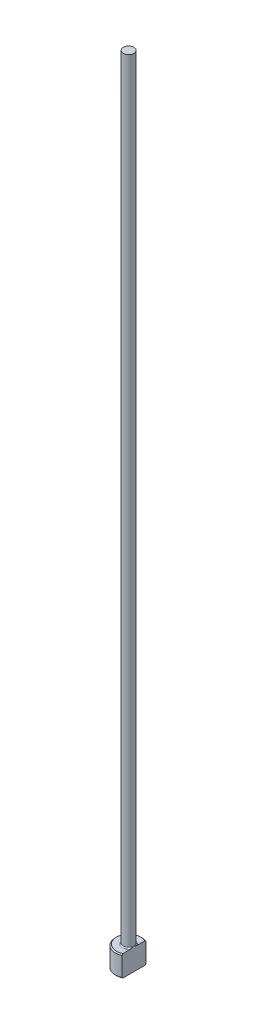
ISO-10303-21;
HEADER;
FILE_DESCRIPTION(('STEP AP214'),'2;1');
FILE_NAME('part.step','',(''),(''),'','','');
FILE_SCHEMA(('AUTOMOTIVE_DESIGN { 1 0 10303 214 1 1 1 1 }'));
ENDSEC;
DATA;
#1=APPLICATION_CONTEXT('core data for automotive mechanical design processes');
#2=APPLICATION_PROTOCOL_DEFINITION('international standard','automotive_design',2000,#1);
#3=PRODUCT_CONTEXT('',#1,'mechanical');
#4=PRODUCT('Part','Part','',(#3));
#5=PRODUCT_RELATED_PRODUCT_CATEGORY('part','',(#4));
#6=PRODUCT_DEFINITION_FORMATION('','',#4);
#7=PRODUCT_DEFINITION_CONTEXT('part definition',#1,'design');
#8=PRODUCT_DEFINITION('design','',#6,#7);
#9=PRODUCT_DEFINITION_SHAPE('','',#8);
#10=(LENGTH_UNIT() NAMED_UNIT(*) SI_UNIT(.MILLI.,.METRE.));
#11=(NAMED_UNIT(*) PLANE_ANGLE_UNIT() SI_UNIT($,.RADIAN.));
#12=(NAMED_UNIT(*) SI_UNIT($,.STERADIAN.) SOLID_ANGLE_UNIT());
#13=UNCERTAINTY_MEASURE_WITH_UNIT(LENGTH_MEASURE(1.E-05),#10,'distance_accuracy_value','');
#14=(GEOMETRIC_REPRESENTATION_CONTEXT(3) GLOBAL_UNCERTAINTY_ASSIGNED_CONTEXT((#13)) GLOBAL_UNIT_ASSIGNED_CONTEXT((#10,
#11,#12)) REPRESENTATION_CONTEXT('',''));
#15=CARTESIAN_POINT('',(0.,0.,0.));
#16=DIRECTION('',(0.,0.,1.));
#17=DIRECTION('',(1.,0.,0.));
#18=AXIS2_PLACEMENT_3D('',#15,#16,#17);
#19=CARTESIAN_POINT('',(0.,0.,0.));
#20=DIRECTION('',(0.,-1.,0.));
#21=DIRECTION('',(0.,0.,-1.));
#22=AXIS2_PLACEMENT_3D('',#19,#20,#21);
#23=PLANE('',#22);
#24=CARTESIAN_POINT('',(0.,0.,0.));
#25=DIRECTION('',(0.,-1.,0.));
#26=DIRECTION('',(0.,0.,-1.));
#27=AXIS2_PLACEMENT_3D('',#24,#25,#26);
#28=CIRCLE('',#27,2.29999999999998);
#29=CARTESIAN_POINT('',(0.999999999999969,0.,2.07123151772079));
#30=VERTEX_POINT('',#29);
#31=CARTESIAN_POINT('',(0.999999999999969,0.,-2.07123151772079));
#32=VERTEX_POINT('',#31);
#33=EDGE_CURVE('E98',#30,#32,#28,.T.);
#34=ORIENTED_EDGE('',*,*,#33,.T.);
#35=DIRECTION('',(0.,0.,1.));
#36=VECTOR('',#35,1.);
#37=CARTESIAN_POINT('',(0.999999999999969,0.,2.2912878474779));
#38=LINE('',#37,#36);
#39=EDGE_CURVE('E83',#32,#30,#38,.T.);
#40=ORIENTED_EDGE('',*,*,#39,.T.);
#41=EDGE_LOOP('',(#34,#40));
#42=FACE_BOUND('',#41,.T.);
#43=ADVANCED_FACE('F32',(#42),#23,.T.);
#44=CARTESIAN_POINT('',(0.,259.958771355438,0.));
#45=DIRECTION('',(0.,1.,0.));
#46=DIRECTION('',(0.,0.,1.));
#47=AXIS2_PLACEMENT_3D('',#44,#45,#46);
#48=CYLINDRICAL_SURFACE('',#47,2.49999999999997);
#49=CARTESIAN_POINT('',(0.,3.80000000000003,0.));
#50=DIRECTION('',(0.,1.,0.));
#51=DIRECTION('',(0.,0.,1.));
#52=AXIS2_PLACEMENT_3D('',#49,#50,#51);
#53=CIRCLE('',#52,2.49999999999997);
#54=CARTESIAN_POINT('',(0.999999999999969,3.80000000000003,2.2912878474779));
#55=VERTEX_POINT('',#54);
#56=CARTESIAN_POINT('',(0.999999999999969,3.80000000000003,-2.2912878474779));
#57=VERTEX_POINT('',#56);
#58=EDGE_CURVE('E104',#55,#57,#53,.F.);
#59=ORIENTED_EDGE('',*,*,#58,.T.);
#60=DIRECTION('',(0.,-1.,0.));
#61=VECTOR('',#60,1.);
#62=CARTESIAN_POINT('',(0.999999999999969,150.,-2.2912878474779));
#63=LINE('',#62,#61);
#64=CARTESIAN_POINT('',(0.999999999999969,0.199999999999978,-2.2912878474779));
#65=VERTEX_POINT('',#64);
#66=EDGE_CURVE('E183',#57,#65,#63,.T.);
#67=ORIENTED_EDGE('',*,*,#66,.T.);
#68=CARTESIAN_POINT('',(0.,0.199999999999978,0.));
#69=DIRECTION('',(0.,-1.,0.));
#70=DIRECTION('',(0.,0.,-1.));
#71=AXIS2_PLACEMENT_3D('',#68,#69,#70);
#72=CIRCLE('',#71,2.49999999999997);
#73=CARTESIAN_POINT('',(0.999999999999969,0.199999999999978,2.2912878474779));
#74=VERTEX_POINT('',#73);
#75=EDGE_CURVE('E100',#65,#74,#72,.F.);
#76=ORIENTED_EDGE('',*,*,#75,.T.);
#77=DIRECTION('',(0.,-1.,0.));
#78=VECTOR('',#77,1.);
#79=CARTESIAN_POINT('',(0.999999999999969,150.,2.2912878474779));
#80=LINE('',#79,#78);
#81=EDGE_CURVE('E93',#55,#74,#80,.T.);
#82=ORIENTED_EDGE('',*,*,#81,.F.);
#83=EDGE_LOOP('',(#59,#67,#76,#82));
#84=FACE_BOUND('',#83,.T.);
#85=ADVANCED_FACE('F158',(#84),#48,.T.);
#86=CARTESIAN_POINT('',(-2.49999999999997,4.,0.));
#87=DIRECTION('',(0.,1.,0.));
#88=DIRECTION('',(0.,0.,1.));
#89=AXIS2_PLACEMENT_3D('',#86,#87,#88);
#90=PLANE('',#89);
#91=CARTESIAN_POINT('',(0.,4.,0.));
#92=DIRECTION('',(0.,1.,0.));
#93=DIRECTION('',(0.,0.,1.));
#94=AXIS2_PLACEMENT_3D('',#91,#92,#93);
#95=CIRCLE('',#94,2.29999999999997);
#96=CARTESIAN_POINT('',(0.999999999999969,4.,-2.07123151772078));
#97=VERTEX_POINT('',#96);
#98=CARTESIAN_POINT('',(0.999999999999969,4.,2.07123151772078));
#99=VERTEX_POINT('',#98);
#100=EDGE_CURVE('E178',#97,#99,#95,.T.);
#101=ORIENTED_EDGE('',*,*,#100,.T.);
#102=DIRECTION('',(0.,0.,-1.));
#103=VECTOR('',#102,1.);
#104=CARTESIAN_POINT('',(0.999999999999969,4.,0.));
#105=LINE('',#104,#103);
#106=CARTESIAN_POINT('',(0.999999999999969,3.99999999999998,0.663324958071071));
#107=VERTEX_POINT('',#106);
#108=EDGE_CURVE('E57',#99,#107,#105,.T.);
#109=ORIENTED_EDGE('',*,*,#108,.T.);
#110=CARTESIAN_POINT('',(0.,4.,0.));
#111=DIRECTION('',(0.,1.,0.));
#112=DIRECTION('',(0.,0.,1.));
#113=AXIS2_PLACEMENT_3D('',#110,#111,#112);
#114=CIRCLE('',#113,1.19999999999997);
#115=CARTESIAN_POINT('',(0.999999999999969,3.99999999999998,-0.663324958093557));
#116=VERTEX_POINT('',#115);
#117=EDGE_CURVE('E107',#107,#116,#114,.F.);
#118=ORIENTED_EDGE('',*,*,#117,.T.);
#119=EDGE_CURVE('E136',#116,#97,#105,.T.);
#120=ORIENTED_EDGE('',*,*,#119,.T.);
#121=EDGE_LOOP('',(#101,#109,#118,#120));
#122=FACE_BOUND('',#121,.T.);
#123=ADVANCED_FACE('F147',(#122),#90,.T.);
#124=CARTESIAN_POINT('',(0.,4.,0.));
#125=DIRECTION('',(0.,-1.,0.));
#126=DIRECTION('',(0.,0.,-1.));
#127=AXIS2_PLACEMENT_3D('',#124,#125,#126);
#128=CONICAL_SURFACE('',#127,2.29999999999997,0.785398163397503);
#129=ORIENTED_EDGE('',*,*,#58,.F.);
#130=CARTESIAN_POINT('',(0.999999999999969,1.15817039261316,5.043650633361));
#131=CARTESIAN_POINT('',(0.999999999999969,1.28171614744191,4.91769392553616));
#132=CARTESIAN_POINT('',(0.999999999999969,1.40517853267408,4.79165523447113));
#133=CARTESIAN_POINT('',(0.999999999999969,1.65205736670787,4.5391725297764));
#134=CARTESIAN_POINT('',(0.999999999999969,1.77547348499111,4.4127281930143));
#135=CARTESIAN_POINT('',(0.999999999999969,2.02507999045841,4.1564175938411));
#136=CARTESIAN_POINT('',(0.999999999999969,2.15126317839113,4.02654431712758));
#137=CARTESIAN_POINT('',(0.999999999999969,2.40304621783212,3.76660249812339));
#138=CARTESIAN_POINT('',(0.999999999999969,2.52864665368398,3.63653452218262));
#139=CARTESIAN_POINT('',(0.999999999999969,2.76776970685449,3.38787610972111));
#140=CARTESIAN_POINT('',(0.999999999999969,2.88133977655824,3.26933134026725));
#141=CARTESIAN_POINT('',(0.999999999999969,3.10787167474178,3.03166264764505));
#142=CARTESIAN_POINT('',(0.999999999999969,3.22083350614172,2.91253872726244));
#143=CARTESIAN_POINT('',(0.999999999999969,3.44656995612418,2.67277252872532));
#144=CARTESIAN_POINT('',(0.999999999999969,3.5593394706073,2.55212543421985));
#145=CARTESIAN_POINT('',(0.999999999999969,3.78351625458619,2.30972256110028));
#146=CARTESIAN_POINT('',(0.999999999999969,3.89492439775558,2.18796759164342));
#147=CARTESIAN_POINT('',(0.999999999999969,4.1131873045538,1.9454858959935));
#148=CARTESIAN_POINT('',(0.999999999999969,4.2200877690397,1.82480064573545));
#149=CARTESIAN_POINT('',(0.999999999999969,4.37813361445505,1.64149718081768));
#150=CARTESIAN_POINT('',(0.999999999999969,4.43049954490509,1.57993333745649));
#151=CARTESIAN_POINT('',(0.999999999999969,4.53410631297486,1.45586813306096));
#152=CARTESIAN_POINT('',(0.999999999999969,4.58534721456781,1.39336682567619));
#153=CARTESIAN_POINT('',(0.999999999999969,4.68568582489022,1.26783988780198));
#154=CARTESIAN_POINT('',(0.999999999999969,4.73480144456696,1.20482863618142));
#155=CARTESIAN_POINT('',(0.999999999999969,4.83086890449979,1.07709082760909));
#156=CARTESIAN_POINT('',(0.999999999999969,4.87781921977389,1.01236311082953));
#157=CARTESIAN_POINT('',(0.999999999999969,4.96818560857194,0.880911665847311));
#158=CARTESIAN_POINT('',(0.999999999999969,5.01161706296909,0.814198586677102));
#159=CARTESIAN_POINT('',(0.999999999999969,5.09325231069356,0.677671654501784));
#160=CARTESIAN_POINT('',(0.999999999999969,5.1314648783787,0.60786327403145));
#161=CARTESIAN_POINT('',(0.999999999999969,5.1726089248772,0.520757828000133));
#162=CARTESIAN_POINT('',(0.999999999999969,5.17963219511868,0.505387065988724));
#163=CARTESIAN_POINT('',(0.999999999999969,5.19324475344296,0.474448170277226));
#164=CARTESIAN_POINT('',(0.999999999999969,5.19983388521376,0.458879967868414));
#165=CARTESIAN_POINT('',(0.999999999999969,5.21887613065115,0.411884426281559));
#166=CARTESIAN_POINT('',(0.999999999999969,5.23060772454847,0.380158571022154));
#167=CARTESIAN_POINT('',(0.999999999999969,5.25156131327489,0.316410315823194));
#168=CARTESIAN_POINT('',(0.999999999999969,5.26081845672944,0.284399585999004));
#169=CARTESIAN_POINT('',(0.999999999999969,5.2766313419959,0.21969696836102));
#170=CARTESIAN_POINT('',(0.999999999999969,5.2831862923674,0.187004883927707));
#171=CARTESIAN_POINT('',(0.999999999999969,5.29332210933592,0.120434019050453));
#172=CARTESIAN_POINT('',(0.999999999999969,5.29683603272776,0.0865448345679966));
#173=CARTESIAN_POINT('',(0.999999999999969,5.30040235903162,0.018593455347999));
#174=CARTESIAN_POINT('',(0.999999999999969,5.30045600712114,-0.0154686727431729));
#175=CARTESIAN_POINT('',(0.999999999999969,5.29709918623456,-0.0834515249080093));
#176=CARTESIAN_POINT('',(0.999999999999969,5.29368537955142,-0.117372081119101));
#177=CARTESIAN_POINT('',(0.999999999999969,5.28362616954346,-0.184734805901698));
#178=CARTESIAN_POINT('',(0.999999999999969,5.27697933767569,-0.218176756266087));
#179=CARTESIAN_POINT('',(0.999999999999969,5.25861838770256,-0.293522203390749));
#180=CARTESIAN_POINT('',(0.999999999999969,5.24601100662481,-0.335206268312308));
#181=CARTESIAN_POINT('',(0.999999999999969,5.21711806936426,-0.417267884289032));
#182=CARTESIAN_POINT('',(0.999999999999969,5.20083078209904,-0.457644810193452));
#183=CARTESIAN_POINT('',(0.999999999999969,5.16531625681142,-0.53739243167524));
#184=CARTESIAN_POINT('',(0.999999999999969,5.14606996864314,-0.576754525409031));
#185=CARTESIAN_POINT('',(0.999999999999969,5.10541239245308,-0.654316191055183));
#186=CARTESIAN_POINT('',(0.999999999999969,5.08400173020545,-0.692516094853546));
#187=CARTESIAN_POINT('',(0.999999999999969,5.03811272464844,-0.770330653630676));
#188=CARTESIAN_POINT('',(0.999999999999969,5.01352589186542,-0.809880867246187));
#189=CARTESIAN_POINT('',(0.999999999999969,4.96292539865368,-0.888061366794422));
#190=CARTESIAN_POINT('',(0.999999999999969,4.93691146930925,-0.926691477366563));
#191=CARTESIAN_POINT('',(0.999999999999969,4.85720012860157,-1.04150369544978));
#192=CARTESIAN_POINT('',(0.999999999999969,4.80186935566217,-1.11654866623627));
#193=CARTESIAN_POINT('',(0.999999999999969,4.68838315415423,-1.26473866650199));
#194=CARTESIAN_POINT('',(0.999999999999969,4.63022092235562,-1.33787839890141));
#195=CARTESIAN_POINT('',(0.999999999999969,4.51208910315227,-1.48269245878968));
#196=CARTESIAN_POINT('',(0.999999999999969,4.45211930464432,-1.55436661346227));
#197=CARTESIAN_POINT('',(0.999999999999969,4.33067987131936,-1.69694421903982));
#198=CARTESIAN_POINT('',(0.999999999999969,4.26920502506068,-1.76784320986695));
#199=CARTESIAN_POINT('',(0.999999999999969,4.14533845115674,-1.90884637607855));
#200=CARTESIAN_POINT('',(0.999999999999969,4.08294663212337,-1.978950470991));
#201=CARTESIAN_POINT('',(0.999999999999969,3.89498664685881,-2.18811918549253));
#202=CARTESIAN_POINT('',(0.999999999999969,3.76842113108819,-2.32628638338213));
#203=CARTESIAN_POINT('',(0.999999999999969,3.53875468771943,-2.57413295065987));
#204=CARTESIAN_POINT('',(0.999999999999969,3.43593273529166,-2.68407249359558));
#205=CARTESIAN_POINT('',(0.999999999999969,3.22955977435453,-2.90326847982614));
#206=CARTESIAN_POINT('',(0.999999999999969,3.12600875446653,-3.01252491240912));
#207=CARTESIAN_POINT('',(0.999999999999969,2.81444279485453,-3.33969806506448));
#208=CARTESIAN_POINT('',(0.999999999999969,2.60565048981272,-3.55687358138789));
#209=CARTESIAN_POINT('',(0.999999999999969,2.19072410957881,-3.98610808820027));
#210=CARTESIAN_POINT('',(0.999999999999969,1.98461149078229,-4.19818787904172));
#211=CARTESIAN_POINT('',(0.999999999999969,1.67496695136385,-4.51569174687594));
#212=CARTESIAN_POINT('',(0.999999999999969,1.57171087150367,-4.62138500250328));
#213=CARTESIAN_POINT('',(0.999999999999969,1.36504682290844,-4.83262218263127));
#214=CARTESIAN_POINT('',(0.999999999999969,1.26163885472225,-4.93816610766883));
#215=CARTESIAN_POINT('',(0.999999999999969,1.15817039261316,-5.043650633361));
#216=B_SPLINE_CURVE_WITH_KNOTS('',3,(#130,#131,#132,#133,#134,#135,#136,#137,#138,#139,#140,
#141,#142,#143,#144,#145,#146,#147,#148,#149,#150,#151,#152,#153,#154,#155,#156,#157,#158,#159,
#160,#161,#162,#163,#164,#165,#166,#167,#168,#169,#170,#171,#172,#173,#174,#175,#176,#177,#178,
#179,#180,#181,#182,#183,#184,#185,#186,#187,#188,#189,#190,#191,#192,#193,#194,#195,#196,#197,
#198,#199,#200,#201,#202,#203,#204,#205,#206,#207,#208,#209,#210,#211,#212,#213,#214,#215),
.UNSPECIFIED.,.F.,.F.,(4,2,2,2,2,2,2,2,2,2,2,2,2,2,2,2,2,2,2,2,2,2,2,2,2,2,2,2,2,2,2,2,2,2,2,2,
2,2,2,2,2,2,4),(0.,0.529299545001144,1.0593722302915,1.60260578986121,2.14504205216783,
2.63754347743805,3.13004253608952,3.62546908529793,4.12055895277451,4.60418442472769,
4.84664313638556,5.08908802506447,5.32873451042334,5.56854727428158,5.80724786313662,
6.04554205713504,6.09623410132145,6.14694429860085,6.24833951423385,6.34820702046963,
6.44810375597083,6.55014736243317,6.6521542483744,6.75425941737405,6.85640974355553,
6.98682841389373,7.11730856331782,7.24866693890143,7.37998744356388,7.51965621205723,
7.65935139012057,7.93894909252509,8.21925538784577,8.49959454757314,8.78110270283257,
9.06263910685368,9.62473592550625,10.0763211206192,10.5279133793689,11.4316934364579,
12.3189018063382,12.7621802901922,13.2054571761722),.UNSPECIFIED.);
#217=EDGE_CURVE('E135',#55,#99,#216,.T.);
#218=ORIENTED_EDGE('',*,*,#217,.T.);
#219=ORIENTED_EDGE('',*,*,#100,.F.);
#220=EDGE_CURVE('E127',#97,#57,#216,.T.);
#221=ORIENTED_EDGE('',*,*,#220,.T.);
#222=EDGE_LOOP('',(#129,#218,#219,#221));
#223=FACE_BOUND('',#222,.T.);
#224=ADVANCED_FACE('F143',(#223),#128,.T.);
#225=CARTESIAN_POINT('',(0.,0.199999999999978,0.));
#226=DIRECTION('',(0.,1.,0.));
#227=DIRECTION('',(0.,0.,1.));
#228=AXIS2_PLACEMENT_3D('',#225,#226,#227);
#229=CONICAL_SURFACE('',#228,2.49999999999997,0.785398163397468);
#230=ORIENTED_EDGE('',*,*,#75,.F.);
#231=CARTESIAN_POINT('',(0.999999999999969,2.84182960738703,-5.043650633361));
#232=CARTESIAN_POINT('',(0.999999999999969,2.71828385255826,-4.91769392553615));
#233=CARTESIAN_POINT('',(0.999999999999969,2.59482146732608,-4.79165523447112));
#234=CARTESIAN_POINT('',(0.999999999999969,2.34794263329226,-4.53917252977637));
#235=CARTESIAN_POINT('',(0.999999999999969,2.224526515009,-4.41272819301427));
#236=CARTESIAN_POINT('',(0.999999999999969,1.97492000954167,-4.15641759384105));
#237=CARTESIAN_POINT('',(0.999999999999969,1.84873682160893,-4.02654431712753));
#238=CARTESIAN_POINT('',(0.999999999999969,1.59695378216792,-3.76660249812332));
#239=CARTESIAN_POINT('',(0.999999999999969,1.47135334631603,-3.63653452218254));
#240=CARTESIAN_POINT('',(0.999999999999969,1.23223029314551,-3.38787610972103));
#241=CARTESIAN_POINT('',(0.999999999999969,1.11866022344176,-3.26933134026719));
#242=CARTESIAN_POINT('',(0.999999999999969,0.892128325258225,-3.03166264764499));
#243=CARTESIAN_POINT('',(0.999999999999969,0.779166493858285,-2.91253872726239));
#244=CARTESIAN_POINT('',(0.999999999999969,0.553430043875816,-2.67277252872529));
#245=CARTESIAN_POINT('',(0.999999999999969,0.440660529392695,-2.55212543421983));
#246=CARTESIAN_POINT('',(0.999999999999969,0.216483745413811,-2.30972256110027));
#247=CARTESIAN_POINT('',(0.999999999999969,0.10507560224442,-2.18796759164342));
#248=CARTESIAN_POINT('',(0.999999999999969,-0.113187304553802,-1.94548589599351));
#249=CARTESIAN_POINT('',(0.999999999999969,-0.220087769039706,-1.82480064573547));
#250=CARTESIAN_POINT('',(0.999999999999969,-0.37813361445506,-1.64149718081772));
#251=CARTESIAN_POINT('',(0.999999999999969,-0.430499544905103,-1.57993333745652));
#252=CARTESIAN_POINT('',(0.999999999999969,-0.534106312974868,-1.455868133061));
#253=CARTESIAN_POINT('',(0.999999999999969,-0.585347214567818,-1.39336682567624));
#254=CARTESIAN_POINT('',(0.999999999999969,-0.685685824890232,-1.26783988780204));
#255=CARTESIAN_POINT('',(0.999999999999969,-0.734801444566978,-1.20482863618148));
#256=CARTESIAN_POINT('',(0.999999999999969,-0.830868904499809,-1.07709082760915));
#257=CARTESIAN_POINT('',(0.999999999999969,-0.877819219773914,-1.0123631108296));
#258=CARTESIAN_POINT('',(0.999999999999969,-0.968185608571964,-0.880911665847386));
#259=CARTESIAN_POINT('',(0.999999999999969,-1.01161706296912,-0.814198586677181));
#260=CARTESIAN_POINT('',(0.999999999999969,-1.0932523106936,-0.677671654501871));
#261=CARTESIAN_POINT('',(0.999999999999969,-1.13146487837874,-0.607863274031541));
#262=CARTESIAN_POINT('',(0.999999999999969,-1.17260892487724,-0.520757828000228));
#263=CARTESIAN_POINT('',(0.999999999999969,-1.17963219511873,-0.505387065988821));
#264=CARTESIAN_POINT('',(0.999999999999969,-1.19324475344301,-0.474448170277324));
#265=CARTESIAN_POINT('',(0.999999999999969,-1.19983388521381,-0.458879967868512));
#266=CARTESIAN_POINT('',(0.999999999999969,-1.21887613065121,-0.41188442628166));
#267=CARTESIAN_POINT('',(0.999999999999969,-1.23060772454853,-0.380158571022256));
#268=CARTESIAN_POINT('',(0.999999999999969,-1.25156131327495,-0.316410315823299));
#269=CARTESIAN_POINT('',(0.999999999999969,-1.26081845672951,-0.284399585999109));
#270=CARTESIAN_POINT('',(0.999999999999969,-1.27663134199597,-0.219696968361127));
#271=CARTESIAN_POINT('',(0.999999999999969,-1.28318629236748,-0.187004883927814));
#272=CARTESIAN_POINT('',(0.999999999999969,-1.29332210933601,-0.120434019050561));
#273=CARTESIAN_POINT('',(0.999999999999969,-1.29683603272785,-0.0865448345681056));
#274=CARTESIAN_POINT('',(0.999999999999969,-1.30040235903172,-0.0185934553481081));
#275=CARTESIAN_POINT('',(0.999999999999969,-1.30045600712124,0.015468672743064));
#276=CARTESIAN_POINT('',(0.999999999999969,-1.29709918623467,0.0834515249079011));
#277=CARTESIAN_POINT('',(0.999999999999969,-1.29368537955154,0.117372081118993));
#278=CARTESIAN_POINT('',(0.999999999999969,-1.28362616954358,0.184734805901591));
#279=CARTESIAN_POINT('',(0.999999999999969,-1.27697933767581,0.218176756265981));
#280=CARTESIAN_POINT('',(0.999999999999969,-1.25861838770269,0.293522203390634));
#281=CARTESIAN_POINT('',(0.999999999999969,-1.24601100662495,0.335206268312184));
#282=CARTESIAN_POINT('',(0.999999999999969,-1.21711806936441,0.417267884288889));
#283=CARTESIAN_POINT('',(0.999999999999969,-1.20083078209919,0.457644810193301));
#284=CARTESIAN_POINT('',(0.999999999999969,-1.16531625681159,0.537392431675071));
#285=CARTESIAN_POINT('',(0.999999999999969,-1.14606996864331,0.576754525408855));
#286=CARTESIAN_POINT('',(0.999999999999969,-1.10541239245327,0.65431619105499));
#287=CARTESIAN_POINT('',(0.999999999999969,-1.08400173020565,0.692516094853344));
#288=CARTESIAN_POINT('',(0.999999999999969,-1.03811272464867,0.770330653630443));
#289=CARTESIAN_POINT('',(0.999999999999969,-1.01352589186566,0.809880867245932));
#290=CARTESIAN_POINT('',(0.999999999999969,-0.962925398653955,0.888061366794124));
#291=CARTESIAN_POINT('',(0.999999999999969,-0.936911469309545,0.926691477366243));
#292=CARTESIAN_POINT('',(0.999999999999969,-0.857200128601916,1.0415036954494));
#293=CARTESIAN_POINT('',(0.999999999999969,-0.801869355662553,1.11654866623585));
#294=CARTESIAN_POINT('',(0.999999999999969,-0.68838315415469,1.26473866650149));
#295=CARTESIAN_POINT('',(0.999999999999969,-0.630220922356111,1.33787839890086));
#296=CARTESIAN_POINT('',(0.999999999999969,-0.512089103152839,1.48269245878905));
#297=CARTESIAN_POINT('',(0.999999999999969,-0.452119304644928,1.5543666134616));
#298=CARTESIAN_POINT('',(0.999999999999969,-0.330679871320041,1.69694421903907));
#299=CARTESIAN_POINT('',(0.999999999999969,-0.269205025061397,1.76784320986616));
#300=CARTESIAN_POINT('',(0.999999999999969,-0.145338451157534,1.90884637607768));
#301=CARTESIAN_POINT('',(0.999999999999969,-0.0829466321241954,1.97895047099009));
#302=CARTESIAN_POINT('',(0.999999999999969,0.105013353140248,2.1881191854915));
#303=CARTESIAN_POINT('',(0.999999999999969,0.231578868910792,2.32628638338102));
#304=CARTESIAN_POINT('',(0.999999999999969,0.461245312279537,2.57413295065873));
#305=CARTESIAN_POINT('',(0.999999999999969,0.564067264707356,2.6840724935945));
#306=CARTESIAN_POINT('',(0.999999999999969,0.770440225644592,2.90326847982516));
#307=CARTESIAN_POINT('',(0.999999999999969,0.873991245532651,3.0125249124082));
#308=CARTESIAN_POINT('',(0.999999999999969,1.18555720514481,3.33969806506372));
#309=CARTESIAN_POINT('',(0.999999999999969,1.39434951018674,3.55687358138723));
#310=CARTESIAN_POINT('',(0.999999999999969,1.80927589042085,3.98610808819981));
#311=CARTESIAN_POINT('',(0.999999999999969,2.01538850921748,4.19818787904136));
#312=CARTESIAN_POINT('',(0.999999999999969,2.32503304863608,4.51569174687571));
#313=CARTESIAN_POINT('',(0.999999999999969,2.42828912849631,4.6213850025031));
#314=CARTESIAN_POINT('',(0.999999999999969,2.63495317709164,4.83262218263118));
#315=CARTESIAN_POINT('',(0.999999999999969,2.73836114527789,4.93816610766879));
#316=CARTESIAN_POINT('',(0.999999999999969,2.84182960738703,5.043650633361));
#317=B_SPLINE_CURVE_WITH_KNOTS('',3,(#231,#232,#233,#234,#235,#236,#237,#238,#239,#240,#241,
#242,#243,#244,#245,#246,#247,#248,#249,#250,#251,#252,#253,#254,#255,#256,#257,#258,#259,#260,
#261,#262,#263,#264,#265,#266,#267,#268,#269,#270,#271,#272,#273,#274,#275,#276,#277,#278,#279,
#280,#281,#282,#283,#284,#285,#286,#287,#288,#289,#290,#291,#292,#293,#294,#295,#296,#297,#298,
#299,#300,#301,#302,#303,#304,#305,#306,#307,#308,#309,#310,#311,#312,#313,#314,#315,#316),
.UNSPECIFIED.,.F.,.F.,(4,2,2,2,2,2,2,2,2,2,2,2,2,2,2,2,2,2,2,2,2,2,2,2,2,2,2,2,2,2,2,2,2,2,2,2,
2,2,2,2,2,2,4),(0.,0.529299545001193,1.0593722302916,1.60260578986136,2.14504205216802,
2.63754347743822,3.13004253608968,3.62546908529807,4.12055895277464,4.6041844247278,
4.84664313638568,5.08908802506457,5.32873451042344,5.56854727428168,5.80724786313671,
6.04554205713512,6.09623410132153,6.14694429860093,6.24833951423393,6.34820702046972,
6.44810375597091,6.55014736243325,6.65215424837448,6.75425941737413,6.85640974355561,
6.98682841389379,7.11730856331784,7.24866693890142,7.37998744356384,7.5196562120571,
7.65935139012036,7.93894909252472,8.21925538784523,8.49959454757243,8.7811027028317,
9.06263910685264,9.62473592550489,10.076321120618,10.527913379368,11.4316934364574,
12.3189018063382,12.7621802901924,13.2054571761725),.UNSPECIFIED.);
#318=EDGE_CURVE('E86',#65,#32,#317,.T.);
#319=ORIENTED_EDGE('',*,*,#318,.T.);
#320=ORIENTED_EDGE('',*,*,#33,.F.);
#321=EDGE_CURVE('E89',#30,#74,#317,.T.);
#322=ORIENTED_EDGE('',*,*,#321,.T.);
#323=EDGE_LOOP('',(#230,#319,#320,#322));
#324=FACE_BOUND('',#323,.T.);
#325=ADVANCED_FACE('F97',(#324),#229,.T.);
#326=CARTESIAN_POINT('',(0.,4.19999999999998,0.));
#327=DIRECTION('',(0.,1.,0.));
#328=DIRECTION('',(0.,0.,1.));
#329=AXIS2_PLACEMENT_3D('',#326,#327,#328);
#330=TOROIDAL_SURFACE('',#329,1.19999999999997,0.2);
#331=CARTESIAN_POINT('',(0.999999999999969,4.19999999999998,0.));
#332=CARTESIAN_POINT('',(0.999999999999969,4.20000051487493,2.59065974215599E-12));
#333=CARTESIAN_POINT('',(0.999999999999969,4.20000102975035,-9.42496361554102E-08));
#334=CARTESIAN_POINT('',(0.999999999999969,4.20000202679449,-4.00799852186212E-07));
#335=CARTESIAN_POINT('',(0.999999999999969,4.20000250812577,-6.15372282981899E-07));
#336=CARTESIAN_POINT('',(0.999999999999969,4.20000346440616,-1.13351403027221E-06));
#337=CARTESIAN_POINT('',(0.999999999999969,4.20000393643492,-1.44235226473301E-06));
#338=CARTESIAN_POINT('',(0.999999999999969,4.20000483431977,-2.11388878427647E-06));
#339=CARTESIAN_POINT('',(0.999999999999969,4.20000526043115,-2.47625954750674E-06));
#340=CARTESIAN_POINT('',(0.999999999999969,4.20000666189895,-3.75794161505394E-06));
#341=CARTESIAN_POINT('',(0.999999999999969,4.2000075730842,-4.74818961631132E-06));
#342=CARTESIAN_POINT('',(0.999999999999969,4.20000922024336,-6.81289838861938E-06));
#343=CARTESIAN_POINT('',(0.999999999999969,4.20000996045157,-7.8841765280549E-06));
#344=CARTESIAN_POINT('',(0.999999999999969,4.20001267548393,-1.19907295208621E-05));
#345=CARTESIAN_POINT('',(0.999999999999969,4.20001450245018,-1.51274185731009E-05));
#346=CARTESIAN_POINT('',(0.999999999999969,4.20001755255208,-2.13715427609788E-05));
#347=CARTESIAN_POINT('',(0.999999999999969,4.20001881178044,-2.44620178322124E-05));
#348=CARTESIAN_POINT('',(0.999999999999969,4.20002404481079,-3.74145212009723E-05));
#349=CARTESIAN_POINT('',(0.999999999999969,4.20002793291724,-4.73052128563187E-05));
#350=CARTESIAN_POINT('',(0.999999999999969,4.2000342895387,-6.59457080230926E-05));
#351=CARTESIAN_POINT('',(0.999999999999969,4.20003688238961,-7.46515304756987E-05));
#352=CARTESIAN_POINT('',(0.999999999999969,4.20005709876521,-0.000137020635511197));
#353=CARTESIAN_POINT('',(0.999999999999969,4.20008244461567,-0.000187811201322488));
#354=CARTESIAN_POINT('',(0.999999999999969,4.20017671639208,-0.000384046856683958));
#355=CARTESIAN_POINT('',(0.999999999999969,4.2002399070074,-0.000531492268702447));
#356=CARTESIAN_POINT('',(0.999999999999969,4.20048701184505,-0.00109942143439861));
#357=CARTESIAN_POINT('',(0.999999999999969,4.20067693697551,-0.00151784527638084));
#358=CARTESIAN_POINT('',(0.999999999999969,4.20144296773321,-0.00321386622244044));
#359=CARTESIAN_POINT('',(0.999999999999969,4.20201230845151,-0.00449374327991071));
#360=CARTESIAN_POINT('',(0.999999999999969,4.20998444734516,-0.0224047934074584));
#361=CARTESIAN_POINT('',(0.999999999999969,4.2174352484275,-0.039020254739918));
#362=CARTESIAN_POINT('',(0.999999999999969,4.23197002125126,-0.0717084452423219));
#363=CARTESIAN_POINT('',(0.999999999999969,4.23905766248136,-0.0877796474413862));
#364=CARTESIAN_POINT('',(0.999999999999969,4.25389009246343,-0.121781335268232));
#365=CARTESIAN_POINT('',(0.999999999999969,4.26161964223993,-0.139718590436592));
#366=CARTESIAN_POINT('',(0.999999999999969,4.27689168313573,-0.175878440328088));
#367=CARTESIAN_POINT('',(0.999999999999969,4.28443162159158,-0.19410211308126));
#368=CARTESIAN_POINT('',(0.999999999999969,4.30282726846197,-0.239840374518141));
#369=CARTESIAN_POINT('',(0.999999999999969,4.31345710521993,-0.267447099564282));
#370=CARTESIAN_POINT('',(0.999999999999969,4.33331094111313,-0.322481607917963));
#371=CARTESIAN_POINT('',(0.999999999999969,4.34256072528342,-0.349899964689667));
#372=CARTESIAN_POINT('',(0.999999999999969,4.35732089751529,-0.398044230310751));
#373=CARTESIAN_POINT('',(0.999999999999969,4.36317895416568,-0.418661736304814));
#374=CARTESIAN_POINT('',(0.999999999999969,4.37387907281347,-0.460275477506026));
#375=CARTESIAN_POINT('',(0.999999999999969,4.37871519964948,-0.48127319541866));
#376=CARTESIAN_POINT('',(0.999999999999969,4.39174175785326,-0.546853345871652));
#377=CARTESIAN_POINT('',(0.999999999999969,4.39776253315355,-0.591947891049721));
#378=CARTESIAN_POINT('',(0.999999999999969,4.400401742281,-0.660990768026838));
#379=CARTESIAN_POINT('',(0.999999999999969,4.400126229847,-0.684818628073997));
#380=CARTESIAN_POINT('',(0.999999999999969,4.39660783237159,-0.732027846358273));
#381=CARTESIAN_POINT('',(0.999999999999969,4.39339826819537,-0.755411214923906));
#382=CARTESIAN_POINT('',(0.999999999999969,4.38447874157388,-0.796083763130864));
#383=CARTESIAN_POINT('',(0.999999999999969,4.37951676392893,-0.813533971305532));
#384=CARTESIAN_POINT('',(0.999999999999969,4.36698902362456,-0.847531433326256));
#385=CARTESIAN_POINT('',(0.999999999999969,4.35942232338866,-0.864078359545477));
#386=CARTESIAN_POINT('',(0.999999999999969,4.34431787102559,-0.890141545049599));
#387=CARTESIAN_POINT('',(0.999999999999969,4.33762931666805,-0.900148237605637));
#388=CARTESIAN_POINT('',(0.999999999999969,4.32281345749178,-0.919033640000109));
#389=CARTESIAN_POINT('',(0.999999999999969,4.3146887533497,-0.92791433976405));
#390=CARTESIAN_POINT('',(0.999999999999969,4.29878569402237,-0.942427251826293));
#391=CARTESIAN_POINT('',(0.999999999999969,4.29127620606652,-0.948352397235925));
#392=CARTESIAN_POINT('',(0.999999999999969,4.27538509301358,-0.958904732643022));
#393=CARTESIAN_POINT('',(0.999999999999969,4.26700378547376,-0.963532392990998));
#394=CARTESIAN_POINT('',(0.999999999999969,4.24944905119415,-0.971220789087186));
#395=CARTESIAN_POINT('',(0.999999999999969,4.24026913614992,-0.974266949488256));
#396=CARTESIAN_POINT('',(0.999999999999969,4.22148612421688,-0.978466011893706));
#397=CARTESIAN_POINT('',(0.999999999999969,4.21188346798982,-0.979620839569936));
#398=CARTESIAN_POINT('',(0.999999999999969,4.19406751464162,-0.979911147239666));
#399=CARTESIAN_POINT('',(0.999999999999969,4.18585759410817,-0.979318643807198));
#400=CARTESIAN_POINT('',(0.999999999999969,4.16966497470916,-0.976727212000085));
#401=CARTESIAN_POINT('',(0.999999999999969,4.16168225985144,-0.97472838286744));
#402=CARTESIAN_POINT('',(0.999999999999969,4.14632905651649,-0.969513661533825));
#403=CARTESIAN_POINT('',(0.999999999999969,4.13894889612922,-0.966325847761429));
#404=CARTESIAN_POINT('',(0.999999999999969,4.12474145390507,-0.958901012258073));
#405=CARTESIAN_POINT('',(0.999999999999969,4.11791436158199,-0.954663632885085));
#406=CARTESIAN_POINT('',(0.999999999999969,4.10210888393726,-0.943323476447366));
#407=CARTESIAN_POINT('',(0.999999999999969,4.09345388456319,-0.935769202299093));
#408=CARTESIAN_POINT('',(0.999999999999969,4.07747441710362,-0.9193596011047));
#409=CARTESIAN_POINT('',(0.999999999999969,4.07015330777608,-0.910501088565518));
#410=CARTESIAN_POINT('',(0.999999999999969,4.05394486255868,-0.887884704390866));
#411=CARTESIAN_POINT('',(0.999999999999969,4.04572469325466,-0.873650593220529));
#412=CARTESIAN_POINT('',(0.999999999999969,4.03162462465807,-0.844119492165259));
#413=CARTESIAN_POINT('',(0.999999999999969,4.02574383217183,-0.828822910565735));
#414=CARTESIAN_POINT('',(0.999999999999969,4.01314628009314,-0.788605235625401));
#415=CARTESIAN_POINT('',(0.999999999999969,4.00790637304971,-0.763225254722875));
#416=CARTESIAN_POINT('',(0.999999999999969,4.00123778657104,-0.711706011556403));
#417=CARTESIAN_POINT('',(0.999999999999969,3.99986086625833,-0.685561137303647));
#418=CARTESIAN_POINT('',(0.999999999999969,4.00029138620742,-0.610897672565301));
#419=CARTESIAN_POINT('',(0.999999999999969,4.00583944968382,-0.562408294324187));
#420=CARTESIAN_POINT('',(0.999999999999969,4.01894675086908,-0.492015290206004));
#421=CARTESIAN_POINT('',(0.999999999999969,4.02392178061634,-0.469516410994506));
#422=CARTESIAN_POINT('',(0.999999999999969,4.03507986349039,-0.424950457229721));
#423=CARTESIAN_POINT('',(0.999999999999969,4.04125559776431,-0.402881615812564));
#424=CARTESIAN_POINT('',(0.999999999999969,4.05640318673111,-0.353063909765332));
#425=CARTESIAN_POINT('',(0.999999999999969,4.06567810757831,-0.32540920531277));
#426=CARTESIAN_POINT('',(0.999999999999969,4.08561584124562,-0.269900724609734));
#427=CARTESIAN_POINT('',(0.999999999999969,4.09630536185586,-0.242056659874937));
#428=CARTESIAN_POINT('',(0.999999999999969,4.11482832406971,-0.195905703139));
#429=CARTESIAN_POINT('',(0.999999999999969,4.12243033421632,-0.177504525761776));
#430=CARTESIAN_POINT('',(0.999999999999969,4.13783353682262,-0.140994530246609));
#431=CARTESIAN_POINT('',(0.999999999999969,4.14563210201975,-0.122884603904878));
#432=CARTESIAN_POINT('',(0.999999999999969,4.16059970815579,-0.0885577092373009));
#433=CARTESIAN_POINT('',(0.999999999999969,4.16775305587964,-0.0723337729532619));
#434=CARTESIAN_POINT('',(0.999999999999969,4.18242403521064,-0.039335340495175));
#435=CARTESIAN_POINT('',(0.999999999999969,4.18994542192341,-0.0225624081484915));
#436=CARTESIAN_POINT('',(0.999999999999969,4.19798770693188,-0.00449370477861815));
#437=CARTESIAN_POINT('',(0.999999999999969,4.19855706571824,-0.00321379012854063));
#438=CARTESIAN_POINT('',(0.999999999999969,4.19932310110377,-0.00151776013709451));
#439=CARTESIAN_POINT('',(0.999999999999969,4.19951301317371,-0.00109936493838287));
#440=CARTESIAN_POINT('',(0.999999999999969,4.19976010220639,-0.000531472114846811));
#441=CARTESIAN_POINT('',(0.999999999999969,4.19982328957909,-0.000384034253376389));
#442=CARTESIAN_POINT('',(0.999999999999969,4.19991755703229,-0.00018780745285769));
#443=CARTESIAN_POINT('',(0.999999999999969,4.19994290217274,-0.000137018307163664));
#444=CARTESIAN_POINT('',(0.999999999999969,4.19996311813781,-7.46508468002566E-05));
#445=CARTESIAN_POINT('',(0.999999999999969,4.19996571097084,-6.59451384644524E-05));
#446=CARTESIAN_POINT('',(0.999999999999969,4.19997206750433,-4.73048902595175E-05));
#447=CARTESIAN_POINT('',(0.999999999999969,4.19997595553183,-3.74143283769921E-05));
#448=CARTESIAN_POINT('',(0.999999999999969,4.19998118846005,-2.44619708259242E-05));
#449=CARTESIAN_POINT('',(0.999999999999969,4.19998244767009,-2.13715143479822E-05));
#450=CARTESIAN_POINT('',(0.999999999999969,4.19998549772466,-1.51274244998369E-05));
#451=CARTESIAN_POINT('',(0.999999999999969,4.19998732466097,-1.19907505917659E-05));
#452=CARTESIAN_POINT('',(0.999999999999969,4.19999003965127,-7.88421144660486E-06));
#453=CARTESIAN_POINT('',(0.999999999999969,4.19999077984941,-6.81293476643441E-06));
#454=CARTESIAN_POINT('',(0.999999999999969,4.19999242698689,-4.74822687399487E-06));
#455=CARTESIAN_POINT('',(0.999999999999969,4.19999333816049,-3.75797821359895E-06));
#456=CARTESIAN_POINT('',(0.999999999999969,4.19999473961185,-2.47629279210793E-06));
#457=CARTESIAN_POINT('',(0.999999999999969,4.19999516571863,-2.11392057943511E-06));
#458=CARTESIAN_POINT('',(0.999999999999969,4.19999606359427,-1.44238034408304E-06));
#459=CARTESIAN_POINT('',(0.999999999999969,4.19999653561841,-1.13353983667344E-06));
#460=CARTESIAN_POINT('',(0.999999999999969,4.1999974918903,-6.15392582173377E-07));
#461=CARTESIAN_POINT('',(0.999999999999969,4.19999797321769,-4.0081700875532E-07));
#462=CARTESIAN_POINT('',(0.999999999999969,4.19999897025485,-9.42592138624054E-08));
#463=CARTESIAN_POINT('',(0.999999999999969,4.19999948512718,-2.59064895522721E-12));
#464=CARTESIAN_POINT('',(0.999999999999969,4.19999999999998,0.));
#465=B_SPLINE_CURVE_WITH_KNOTS('',3,(#331,#332,#333,#334,#335,#336,#337,#338,#339,#340,#341,
#342,#343,#344,#345,#346,#347,#348,#349,#350,#351,#352,#353,#354,#355,#356,#357,#358,#359,#360,
#361,#362,#363,#364,#365,#366,#367,#368,#369,#370,#371,#372,#373,#374,#375,#376,#377,#378,#379,
#380,#381,#382,#383,#384,#385,#386,#387,#388,#389,#390,#391,#392,#393,#394,#395,#396,#397,#398,
#399,#400,#401,#402,#403,#404,#405,#406,#407,#408,#409,#410,#411,#412,#413,#414,#415,#416,#417,
#418,#419,#420,#421,#422,#423,#424,#425,#426,#427,#428,#429,#430,#431,#432,#433,#434,#435,#436,
#437,#438,#439,#440,#441,#442,#443,#444,#445,#446,#447,#448,#449,#450,#451,#452,#453,#454,#455,
#456,#457,#458,#459,#460,#461,#462,#463,#464),.UNSPECIFIED.,.T.,.F.,(4,2,2,2,2,2,2,2,2,2,2,2,2,
2,2,2,2,2,2,2,2,2,2,2,2,2,2,2,2,2,2,2,2,2,2,2,2,2,2,2,2,2,2,2,2,2,2,2,2,2,2,2,2,2,2,2,2,2,2,2,2,
2,2,2,2,2,4),(0.,1.54318091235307E-06,3.11656704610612E-06,4.80252014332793E-06,
6.4785555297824E-06,1.04956561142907E-05,1.4398891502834E-05,2.52504393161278E-05,
3.52518424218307E-05,6.71249457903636E-05,9.43496749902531E-05,0.000263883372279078,
0.000745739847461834,0.00212351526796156,0.00632669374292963,0.0609485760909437,
0.11364394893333,0.172237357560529,0.23140101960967,0.320129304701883,0.40690543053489,
0.471177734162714,0.535813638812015,0.67161710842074,0.742973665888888,0.813529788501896,
0.867802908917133,0.922095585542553,0.958095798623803,0.994031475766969,1.02261929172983,
1.05119673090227,1.08003306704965,1.1088400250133,1.1334101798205,1.15797860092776,
1.18200020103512,1.20602999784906,1.24030227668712,1.27465969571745,1.32369575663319,
1.37271307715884,1.45002425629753,1.52836647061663,1.67385288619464,1.74297459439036,
1.81168748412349,1.89915940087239,1.98861529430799,2.04834216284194,2.10749314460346,
2.16068730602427,2.21582681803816,2.22003012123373,2.221407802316,2.22188963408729,
2.2220591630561,2.22208638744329,2.22211826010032,2.22212826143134,2.22213911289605,
2.22214301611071,2.22214703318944,2.22214870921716,2.22215039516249,2.22215196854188,
2.22215351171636),.UNSPECIFIED.);
#466=CARTESIAN_POINT('',(0.999999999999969,4.19999999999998,0.));
#467=VERTEX_POINT('',#466);
#468=EDGE_CURVE('E11',#116,#467,#465,.T.);
#469=ORIENTED_EDGE('',*,*,#468,.F.);
#470=ORIENTED_EDGE('',*,*,#117,.F.);
#471=CARTESIAN_POINT('',(0.999999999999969,4.19999999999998,0.));
#472=CARTESIAN_POINT('',(0.999999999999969,4.19999948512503,-2.59066338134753E-12));
#473=CARTESIAN_POINT('',(0.999999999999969,4.19999897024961,9.42496361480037E-08));
#474=CARTESIAN_POINT('',(0.999999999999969,4.19999797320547,4.00799852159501E-07));
#475=CARTESIAN_POINT('',(0.999999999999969,4.19999749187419,6.15372282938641E-07));
#476=CARTESIAN_POINT('',(0.999999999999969,4.1999965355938,1.13351403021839E-06));
#477=CARTESIAN_POINT('',(0.999999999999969,4.19999606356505,1.44235226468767E-06));
#478=CARTESIAN_POINT('',(0.999999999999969,4.19999516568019,2.1138887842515E-06));
#479=CARTESIAN_POINT('',(0.999999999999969,4.19999473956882,2.47625954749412E-06));
#480=CARTESIAN_POINT('',(0.999999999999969,4.19999333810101,3.75794161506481E-06));
#481=CARTESIAN_POINT('',(0.999999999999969,4.19999242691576,4.74818961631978E-06));
#482=CARTESIAN_POINT('',(0.999999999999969,4.1999907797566,6.8128983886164E-06));
#483=CARTESIAN_POINT('',(0.999999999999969,4.19999003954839,7.88417652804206E-06));
#484=CARTESIAN_POINT('',(0.999999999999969,4.19998732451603,1.19907295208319E-05));
#485=CARTESIAN_POINT('',(0.999999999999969,4.19998549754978,1.5127418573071E-05));
#486=CARTESIAN_POINT('',(0.999999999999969,4.19998244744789,2.13715427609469E-05));
#487=CARTESIAN_POINT('',(0.999999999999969,4.19998118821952,2.44620178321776E-05));
#488=CARTESIAN_POINT('',(0.999999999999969,4.19997595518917,3.74145212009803E-05));
#489=CARTESIAN_POINT('',(0.999999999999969,4.19997206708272,4.73052128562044E-05));
#490=CARTESIAN_POINT('',(0.999999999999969,4.19996571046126,6.59457080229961E-05));
#491=CARTESIAN_POINT('',(0.999999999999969,4.19996311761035,7.46515304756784E-05));
#492=CARTESIAN_POINT('',(0.999999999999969,4.19994290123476,0.000137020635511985));
#493=CARTESIAN_POINT('',(0.999999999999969,4.19991755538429,0.000187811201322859));
#494=CARTESIAN_POINT('',(0.999999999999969,4.19982328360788,0.00038404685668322));
#495=CARTESIAN_POINT('',(0.999999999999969,4.19976009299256,0.000531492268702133));
#496=CARTESIAN_POINT('',(0.999999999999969,4.19951298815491,0.0010994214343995));
#497=CARTESIAN_POINT('',(0.999999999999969,4.19932306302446,0.00151784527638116));
#498=CARTESIAN_POINT('',(0.999999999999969,4.19855703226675,0.00321386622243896));
#499=CARTESIAN_POINT('',(0.999999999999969,4.19798769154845,0.00449374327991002));
#500=CARTESIAN_POINT('',(0.999999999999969,4.19001555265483,0.0224047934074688));
#501=CARTESIAN_POINT('',(0.999999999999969,4.18256475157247,0.0390202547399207));
#502=CARTESIAN_POINT('',(0.999999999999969,4.16802997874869,0.0717084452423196));
#503=CARTESIAN_POINT('',(0.999999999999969,4.1609423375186,0.0877796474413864));
#504=CARTESIAN_POINT('',(0.999999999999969,4.14610990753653,0.121781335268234));
#505=CARTESIAN_POINT('',(0.999999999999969,4.13838035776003,0.139718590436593));
#506=CARTESIAN_POINT('',(0.999999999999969,4.12310831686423,0.175878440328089));
#507=CARTESIAN_POINT('',(0.999999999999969,4.11556837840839,0.194102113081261));
#508=CARTESIAN_POINT('',(0.999999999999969,4.09717273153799,0.239840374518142));
#509=CARTESIAN_POINT('',(0.999999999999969,4.08654289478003,0.267447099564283));
#510=CARTESIAN_POINT('',(0.999999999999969,4.06668905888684,0.322481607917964));
#511=CARTESIAN_POINT('',(0.999999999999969,4.05743927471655,0.349899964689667));
#512=CARTESIAN_POINT('',(0.999999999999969,4.04267910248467,0.398044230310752));
#513=CARTESIAN_POINT('',(0.999999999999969,4.03682104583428,0.418661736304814));
#514=CARTESIAN_POINT('',(0.999999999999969,4.02612092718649,0.460275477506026));
#515=CARTESIAN_POINT('',(0.999999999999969,4.02128480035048,0.48127319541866));
#516=CARTESIAN_POINT('',(0.999999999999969,4.0082582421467,0.546853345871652));
#517=CARTESIAN_POINT('',(0.999999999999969,4.00223746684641,0.591947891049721));
#518=CARTESIAN_POINT('',(0.999999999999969,3.99959825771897,0.660990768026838));
#519=CARTESIAN_POINT('',(0.999999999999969,3.99987377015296,0.684818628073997));
#520=CARTESIAN_POINT('',(0.999999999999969,4.00339216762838,0.732027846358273));
#521=CARTESIAN_POINT('',(0.999999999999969,4.00660173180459,0.755411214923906));
#522=CARTESIAN_POINT('',(0.999999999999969,4.01552125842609,0.796083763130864));
#523=CARTESIAN_POINT('',(0.999999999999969,4.02048323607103,0.813533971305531));
#524=CARTESIAN_POINT('',(0.999999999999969,4.0330109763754,0.847531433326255));
#525=CARTESIAN_POINT('',(0.999999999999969,4.0405776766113,0.864078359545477));
#526=CARTESIAN_POINT('',(0.999999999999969,4.05568212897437,0.890141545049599));
#527=CARTESIAN_POINT('',(0.999999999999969,4.06237068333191,0.900148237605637));
#528=CARTESIAN_POINT('',(0.999999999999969,4.07718654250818,0.919033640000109));
#529=CARTESIAN_POINT('',(0.999999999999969,4.08531124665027,0.92791433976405));
#530=CARTESIAN_POINT('',(0.999999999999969,4.10121430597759,0.942427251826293));
#531=CARTESIAN_POINT('',(0.999999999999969,4.10872379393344,0.948352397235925));
#532=CARTESIAN_POINT('',(0.999999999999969,4.12461490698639,0.958904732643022));
#533=CARTESIAN_POINT('',(0.999999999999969,4.1329962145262,0.963532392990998));
#534=CARTESIAN_POINT('',(0.999999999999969,4.15055094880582,0.971220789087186));
#535=CARTESIAN_POINT('',(0.999999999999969,4.15973086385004,0.974266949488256));
#536=CARTESIAN_POINT('',(0.999999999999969,4.17851387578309,0.978466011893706));
#537=CARTESIAN_POINT('',(0.999999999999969,4.18811653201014,0.979620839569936));
#538=CARTESIAN_POINT('',(0.999999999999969,4.20593248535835,0.979911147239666));
#539=CARTESIAN_POINT('',(0.999999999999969,4.2141424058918,0.979318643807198));
#540=CARTESIAN_POINT('',(0.999999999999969,4.2303350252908,0.976727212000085));
#541=CARTESIAN_POINT('',(0.999999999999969,4.23831774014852,0.97472838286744));
#542=CARTESIAN_POINT('',(0.999999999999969,4.25367094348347,0.969513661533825));
#543=CARTESIAN_POINT('',(0.999999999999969,4.26105110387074,0.966325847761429));
#544=CARTESIAN_POINT('',(0.999999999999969,4.2752585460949,0.958901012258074));
#545=CARTESIAN_POINT('',(0.999999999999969,4.28208563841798,0.954663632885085));
#546=CARTESIAN_POINT('',(0.999999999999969,4.2978911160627,0.943323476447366));
#547=CARTESIAN_POINT('',(0.999999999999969,4.30654611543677,0.935769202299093));
#548=CARTESIAN_POINT('',(0.999999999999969,4.32252558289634,0.9193596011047));
#549=CARTESIAN_POINT('',(0.999999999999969,4.32984669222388,0.910501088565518));
#550=CARTESIAN_POINT('',(0.999999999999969,4.34605513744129,0.887884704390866));
#551=CARTESIAN_POINT('',(0.999999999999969,4.3542753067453,0.873650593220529));
#552=CARTESIAN_POINT('',(0.999999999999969,4.36837537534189,0.844119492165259));
#553=CARTESIAN_POINT('',(0.999999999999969,4.37425616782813,0.828822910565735));
#554=CARTESIAN_POINT('',(0.999999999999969,4.38685371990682,0.788605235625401));
#555=CARTESIAN_POINT('',(0.999999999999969,4.39209362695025,0.763225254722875));
#556=CARTESIAN_POINT('',(0.999999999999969,4.39876221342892,0.711706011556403));
#557=CARTESIAN_POINT('',(0.999999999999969,4.40013913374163,0.685561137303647));
#558=CARTESIAN_POINT('',(0.999999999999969,4.39970861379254,0.610897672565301));
#559=CARTESIAN_POINT('',(0.999999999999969,4.39416055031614,0.562408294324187));
#560=CARTESIAN_POINT('',(0.999999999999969,4.38105324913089,0.492015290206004));
#561=CARTESIAN_POINT('',(0.999999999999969,4.37607821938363,0.469516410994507));
#562=CARTESIAN_POINT('',(0.999999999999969,4.36492013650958,0.424950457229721));
#563=CARTESIAN_POINT('',(0.999999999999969,4.35874440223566,0.402881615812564));
#564=CARTESIAN_POINT('',(0.999999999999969,4.34359681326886,0.353063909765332));
#565=CARTESIAN_POINT('',(0.999999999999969,4.33432189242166,0.325409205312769));
#566=CARTESIAN_POINT('',(0.999999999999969,4.31438415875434,0.269900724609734));
#567=CARTESIAN_POINT('',(0.999999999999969,4.3036946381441,0.242056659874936));
#568=CARTESIAN_POINT('',(0.999999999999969,4.28517167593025,0.195905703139));
#569=CARTESIAN_POINT('',(0.999999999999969,4.27756966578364,0.177504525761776));
#570=CARTESIAN_POINT('',(0.999999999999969,4.26216646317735,0.140994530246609));
#571=CARTESIAN_POINT('',(0.999999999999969,4.25436789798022,0.122884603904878));
#572=CARTESIAN_POINT('',(0.999999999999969,4.23940029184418,0.0885577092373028));
#573=CARTESIAN_POINT('',(0.999999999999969,4.23224694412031,0.0723337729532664));
#574=CARTESIAN_POINT('',(0.999999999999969,4.21757596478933,0.0393353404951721));
#575=CARTESIAN_POINT('',(0.999999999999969,4.21005457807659,0.022562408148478));
#576=CARTESIAN_POINT('',(0.999999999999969,4.20201229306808,0.0044937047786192));
#577=CARTESIAN_POINT('',(0.999999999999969,4.20144293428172,0.00321379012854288));
#578=CARTESIAN_POINT('',(0.999999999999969,4.2006768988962,0.00151776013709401));
#579=CARTESIAN_POINT('',(0.999999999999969,4.20048698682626,0.0010993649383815));
#580=CARTESIAN_POINT('',(0.999999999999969,4.20023989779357,0.000531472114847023));
#581=CARTESIAN_POINT('',(0.999999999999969,4.20017671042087,0.000384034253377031));
#582=CARTESIAN_POINT('',(0.999999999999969,4.20008244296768,0.000187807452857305));
#583=CARTESIAN_POINT('',(0.999999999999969,4.20005709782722,0.000137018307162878));
#584=CARTESIAN_POINT('',(0.999999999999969,4.20003688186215,7.46508468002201E-05));
#585=CARTESIAN_POINT('',(0.999999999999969,4.20003428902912,6.59451384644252E-05));
#586=CARTESIAN_POINT('',(0.999999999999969,4.20002793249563,4.7304890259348E-05));
#587=CARTESIAN_POINT('',(0.999999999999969,4.20002404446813,3.74143283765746E-05));
#588=CARTESIAN_POINT('',(0.999999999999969,4.20001881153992,2.44619708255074E-05));
#589=CARTESIAN_POINT('',(0.999999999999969,4.20001755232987,2.13715143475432E-05));
#590=CARTESIAN_POINT('',(0.999999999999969,4.20001450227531,1.51274244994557E-05));
#591=CARTESIAN_POINT('',(0.999999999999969,4.20001267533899,1.19907505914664E-05));
#592=CARTESIAN_POINT('',(0.999999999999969,4.20000996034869,7.88421144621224E-06));
#593=CARTESIAN_POINT('',(0.999999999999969,4.20000922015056,6.8129347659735E-06));
#594=CARTESIAN_POINT('',(0.999999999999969,4.20000757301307,4.74822687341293E-06));
#595=CARTESIAN_POINT('',(0.999999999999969,4.20000666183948,3.75797821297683E-06));
#596=CARTESIAN_POINT('',(0.999999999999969,4.20000526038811,2.47629279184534E-06));
#597=CARTESIAN_POINT('',(0.999999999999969,4.20000483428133,2.11392057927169E-06));
#598=CARTESIAN_POINT('',(0.999999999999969,4.20000393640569,1.44238034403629E-06));
#599=CARTESIAN_POINT('',(0.999999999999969,4.20000346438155,1.1335398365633E-06));
#600=CARTESIAN_POINT('',(0.999999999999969,4.20000250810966,6.15392582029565E-07));
#601=CARTESIAN_POINT('',(0.999999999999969,4.20000202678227,4.00817008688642E-07));
#602=CARTESIAN_POINT('',(0.999999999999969,4.20000102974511,9.42592138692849E-08));
#603=CARTESIAN_POINT('',(0.999999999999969,4.20000051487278,2.59065259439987E-12));
#604=CARTESIAN_POINT('',(0.999999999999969,4.19999999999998,0.));
#605=B_SPLINE_CURVE_WITH_KNOTS('',3,(#471,#472,#473,#474,#475,#476,#477,#478,#479,#480,#481,
#482,#483,#484,#485,#486,#487,#488,#489,#490,#491,#492,#493,#494,#495,#496,#497,#498,#499,#500,
#501,#502,#503,#504,#505,#506,#507,#508,#509,#510,#511,#512,#513,#514,#515,#516,#517,#518,#519,
#520,#521,#522,#523,#524,#525,#526,#527,#528,#529,#530,#531,#532,#533,#534,#535,#536,#537,#538,
#539,#540,#541,#542,#543,#544,#545,#546,#547,#548,#549,#550,#551,#552,#553,#554,#555,#556,#557,
#558,#559,#560,#561,#562,#563,#564,#565,#566,#567,#568,#569,#570,#571,#572,#573,#574,#575,#576,
#577,#578,#579,#580,#581,#582,#583,#584,#585,#586,#587,#588,#589,#590,#591,#592,#593,#594,#595,
#596,#597,#598,#599,#600,#601,#602,#603,#604),.UNSPECIFIED.,.T.,.F.,(4,2,2,2,2,2,2,2,2,2,2,2,2,
2,2,2,2,2,2,2,2,2,2,2,2,2,2,2,2,2,2,2,2,2,2,2,2,2,2,2,2,2,2,2,2,2,2,2,2,2,2,2,2,2,2,2,2,2,2,2,2,
2,2,2,2,2,4),(0.,1.54318091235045E-06,3.11656704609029E-06,4.80252014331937E-06,
6.47855552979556E-06,1.04956561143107E-05,1.43988915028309E-05,2.52504393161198E-05,
3.52518424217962E-05,6.71249457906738E-05,9.43496749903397E-05,0.000263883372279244,
0.000745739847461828,0.00212351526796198,0.0063266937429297,0.0609485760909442,
0.113643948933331,0.172237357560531,0.23140101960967,0.320129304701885,0.40690543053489,
0.471177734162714,0.535813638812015,0.67161710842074,0.742973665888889,0.813529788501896,
0.867802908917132,0.922095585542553,0.958095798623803,0.994031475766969,1.02261929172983,
1.05119673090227,1.08003306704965,1.1088400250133,1.1334101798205,1.15797860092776,
1.18200020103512,1.20602999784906,1.24030227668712,1.27465969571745,1.32369575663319,
1.37271307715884,1.45002425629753,1.52836647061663,1.67385288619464,1.74297459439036,
1.81168748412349,1.89915940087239,1.98861529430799,2.04834216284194,2.10749314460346,
2.16068730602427,2.21582681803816,2.22003012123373,2.221407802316,2.22188963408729,
2.2220591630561,2.22208638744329,2.22211826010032,2.22212826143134,2.22213911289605,
2.22214301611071,2.22214703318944,2.22214870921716,2.22215039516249,2.22215196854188,
2.22215351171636),.UNSPECIFIED.);
#606=EDGE_CURVE('E46',#467,#107,#605,.T.);
#607=ORIENTED_EDGE('',*,*,#606,.F.);
#608=CARTESIAN_POINT('',(0.,4.19999999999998,0.));
#609=DIRECTION('',(0.,1.,0.));
#610=DIRECTION('',(0.,0.,1.));
#611=AXIS2_PLACEMENT_3D('',#608,#609,#610);
#612=CIRCLE('',#611,0.999999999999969);
#613=EDGE_CURVE('E103',#467,#467,#612,.T.);
#614=ORIENTED_EDGE('',*,*,#613,.F.);
#615=EDGE_LOOP('',(#469,#470,#607,#614));
#616=FACE_BOUND('',#615,.T.);
#617=ADVANCED_FACE('F34',(#616),#330,.F.);
#618=CARTESIAN_POINT('',(0.,259.958771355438,0.));
#619=DIRECTION('',(0.,1.,0.));
#620=DIRECTION('',(0.,0.,1.));
#621=AXIS2_PLACEMENT_3D('',#618,#619,#620);
#622=CYLINDRICAL_SURFACE('',#621,0.999999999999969);
#623=ORIENTED_EDGE('',*,*,#613,.T.);
#624=EDGE_LOOP('',(#623));
#625=FACE_BOUND('',#624,.T.);
#626=CARTESIAN_POINT('',(0.,150.,0.));
#627=DIRECTION('',(0.,1.,0.));
#628=DIRECTION('',(0.,0.,1.));
#629=AXIS2_PLACEMENT_3D('',#626,#627,#628);
#630=CIRCLE('',#629,0.999999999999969);
#631=CARTESIAN_POINT('',(0.,150.,0.999999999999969));
#632=VERTEX_POINT('',#631);
#633=EDGE_CURVE('E101',#632,#632,#630,.T.);
#634=ORIENTED_EDGE('',*,*,#633,.F.);
#635=EDGE_LOOP('',(#634));
#636=FACE_BOUND('',#635,.T.);
#637=ADVANCED_FACE('F155',(#625,#636),#622,.T.);
#638=CARTESIAN_POINT('',(-0.999999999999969,150.,0.));
#639=DIRECTION('',(0.,1.,0.));
#640=DIRECTION('',(0.,0.,1.));
#641=AXIS2_PLACEMENT_3D('',#638,#639,#640);
#642=PLANE('',#641);
#643=ORIENTED_EDGE('',*,*,#633,.T.);
#644=EDGE_LOOP('',(#643));
#645=FACE_BOUND('',#644,.T.);
#646=ADVANCED_FACE('F121',(#645),#642,.T.);
#647=CARTESIAN_POINT('',(0.999999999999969,150.,2.2912878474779));
#648=DIRECTION('',(1.,0.,0.));
#649=DIRECTION('',(0.,0.,-1.));
#650=AXIS2_PLACEMENT_3D('',#647,#648,#649);
#651=PLANE('',#650);
#652=ORIENTED_EDGE('',*,*,#66,.F.);
#653=ORIENTED_EDGE('',*,*,#220,.F.);
#654=ORIENTED_EDGE('',*,*,#119,.F.);
#655=ORIENTED_EDGE('',*,*,#468,.T.);
#656=ORIENTED_EDGE('',*,*,#606,.T.);
#657=ORIENTED_EDGE('',*,*,#108,.F.);
#658=ORIENTED_EDGE('',*,*,#217,.F.);
#659=ORIENTED_EDGE('',*,*,#81,.T.);
#660=ORIENTED_EDGE('',*,*,#321,.F.);
#661=ORIENTED_EDGE('',*,*,#39,.F.);
#662=ORIENTED_EDGE('',*,*,#318,.F.);
#663=EDGE_LOOP('',(#652,#653,#654,#655,#656,#657,#658,#659,#660,#661,#662));
#664=FACE_BOUND('',#663,.T.);
#665=ADVANCED_FACE('F85',(#664),#651,.T.);
#666=CLOSED_SHELL('',(#43,#85,#123,#224,#325,#617,#637,#646,#665));
#667=MANIFOLD_SOLID_BREP('B2',#666);
#668=ADVANCED_BREP_SHAPE_REPRESENTATION('',(#18,#667),#14);
#669=SHAPE_DEFINITION_REPRESENTATION(#9,#668);
ENDSEC;
END-ISO-10303-21;
